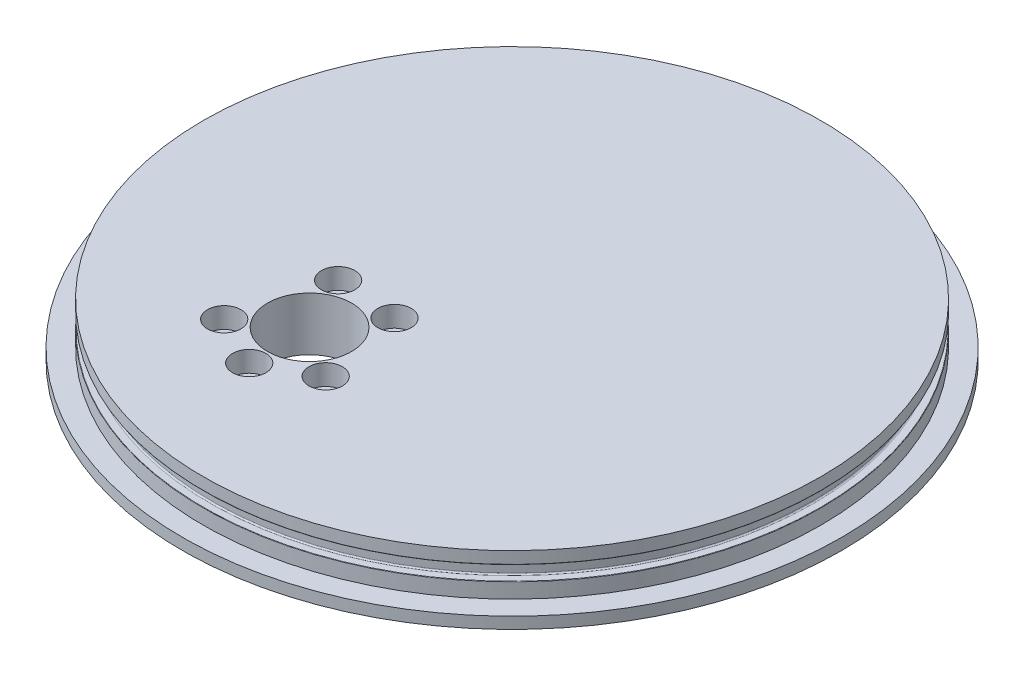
ISO-10303-21;
HEADER;
FILE_DESCRIPTION(('STEP AP214'),'2;1');
FILE_NAME('part.step','',(''),(''),'','','');
FILE_SCHEMA(('AUTOMOTIVE_DESIGN { 1 0 10303 214 1 1 1 1 }'));
ENDSEC;
DATA;
#1=APPLICATION_CONTEXT('core data for automotive mechanical design processes');
#2=APPLICATION_PROTOCOL_DEFINITION('international standard','automotive_design',2000,#1);
#3=PRODUCT_CONTEXT('',#1,'mechanical');
#4=PRODUCT('Part','Part','',(#3));
#5=PRODUCT_RELATED_PRODUCT_CATEGORY('part','',(#4));
#6=PRODUCT_DEFINITION_FORMATION('','',#4);
#7=PRODUCT_DEFINITION_CONTEXT('part definition',#1,'design');
#8=PRODUCT_DEFINITION('design','',#6,#7);
#9=PRODUCT_DEFINITION_SHAPE('','',#8);
#10=(LENGTH_UNIT() NAMED_UNIT(*) SI_UNIT(.MILLI.,.METRE.));
#11=(NAMED_UNIT(*) PLANE_ANGLE_UNIT() SI_UNIT($,.RADIAN.));
#12=(NAMED_UNIT(*) SI_UNIT($,.STERADIAN.) SOLID_ANGLE_UNIT());
#13=UNCERTAINTY_MEASURE_WITH_UNIT(LENGTH_MEASURE(1.E-05),#10,'distance_accuracy_value','');
#14=(GEOMETRIC_REPRESENTATION_CONTEXT(3) GLOBAL_UNCERTAINTY_ASSIGNED_CONTEXT((#13)) GLOBAL_UNIT_ASSIGNED_CONTEXT((#10,
#11,#12)) REPRESENTATION_CONTEXT('',''));
#15=CARTESIAN_POINT('',(0.,0.,0.));
#16=DIRECTION('',(0.,0.,1.));
#17=DIRECTION('',(1.,0.,0.));
#18=AXIS2_PLACEMENT_3D('',#15,#16,#17);
#19=CARTESIAN_POINT('',(0.,13.97,0.));
#20=DIRECTION('',(0.,-1.,0.));
#21=DIRECTION('',(1.,0.,0.));
#22=AXIS2_PLACEMENT_3D('',#19,#20,#21);
#23=PLANE('',#22);
#24=CARTESIAN_POINT('',(-34.2101364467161,13.97,23.5992409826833));
#25=DIRECTION('',(0.,1.,0.));
#26=DIRECTION('',(0.,0.,1.));
#27=AXIS2_PLACEMENT_3D('',#24,#25,#26);
#28=CIRCLE('',#27,5.55625);
#29=CARTESIAN_POINT('',(-34.2101364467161,13.97,29.1554909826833));
#30=VERTEX_POINT('',#29);
#31=EDGE_CURVE('E155',#30,#30,#28,.T.);
#32=ORIENTED_EDGE('',*,*,#31,.F.);
#33=EDGE_LOOP('',(#32));
#34=FACE_BOUND('',#33,.T.);
#35=CARTESIAN_POINT('',(-13.9474857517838,13.97,25.1248185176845));
#36=DIRECTION('',(0.,1.,0.));
#37=DIRECTION('',(0.,0.,1.));
#38=AXIS2_PLACEMENT_3D('',#35,#36,#37);
#39=CIRCLE('',#38,5.55625);
#40=CARTESIAN_POINT('',(-13.9474857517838,13.97,30.6810685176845));
#41=VERTEX_POINT('',#40);
#42=EDGE_CURVE('E143',#41,#41,#39,.T.);
#43=ORIENTED_EDGE('',*,*,#42,.F.);
#44=EDGE_LOOP('',(#43));
#45=FACE_BOUND('',#44,.T.);
#46=CARTESIAN_POINT('',(-41.8892371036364,13.97,53.7846561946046));
#47=DIRECTION('',(0.,1.,0.));
#48=DIRECTION('',(0.,0.,1.));
#49=AXIS2_PLACEMENT_3D('',#46,#47,#48);
#50=CIRCLE('',#49,5.55625);
#51=CARTESIAN_POINT('',(-41.8892371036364,13.97,59.3409061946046));
#52=VERTEX_POINT('',#51);
#53=EDGE_CURVE('E131',#52,#52,#50,.T.);
#54=ORIENTED_EDGE('',*,*,#53,.F.);
#55=EDGE_LOOP('',(#54));
#56=FACE_BOUND('',#55,.T.);
#57=CARTESIAN_POINT('',(-25.1306889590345,13.97,62.2282152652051));
#58=DIRECTION('',(0.,1.,0.));
#59=DIRECTION('',(0.,0.,1.));
#60=AXIS2_PLACEMENT_3D('',#57,#58,#59);
#61=CIRCLE('',#60,5.55625);
#62=CARTESIAN_POINT('',(-25.1306889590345,13.97,67.7844652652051));
#63=VERTEX_POINT('',#62);
#64=EDGE_CURVE('E119',#63,#63,#61,.T.);
#65=ORIENTED_EDGE('',*,*,#64,.F.);
#66=EDGE_LOOP('',(#65));
#67=FACE_BOUND('',#66,.T.);
#68=CARTESIAN_POINT('',(-8.60182196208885,13.97,53.3434428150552));
#69=DIRECTION('',(0.,1.,0.));
#70=DIRECTION('',(0.,0.,1.));
#71=AXIS2_PLACEMENT_3D('',#68,#69,#70);
#72=CIRCLE('',#71,5.55625);
#73=CARTESIAN_POINT('',(-8.60182196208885,13.97,58.8996928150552));
#74=VERTEX_POINT('',#73);
#75=EDGE_CURVE('E107',#74,#74,#72,.T.);
#76=ORIENTED_EDGE('',*,*,#75,.F.);
#77=EDGE_LOOP('',(#76));
#78=FACE_BOUND('',#77,.T.);
#79=CARTESIAN_POINT('',(-25.4,13.97,41.91));
#80=DIRECTION('',(0.,1.,0.));
#81=DIRECTION('',(-1.,0.,0.));
#82=AXIS2_PLACEMENT_3D('',#79,#80,#81);
#83=CIRCLE('',#82,13.97);
#84=CARTESIAN_POINT('',(-39.37,13.97,41.91));
#85=VERTEX_POINT('',#84);
#86=EDGE_CURVE('E93',#85,#85,#83,.T.);
#87=ORIENTED_EDGE('',*,*,#86,.F.);
#88=EDGE_LOOP('',(#87));
#89=FACE_BOUND('',#88,.T.);
#90=CARTESIAN_POINT('',(0.,13.97,0.));
#91=DIRECTION('',(0.,-1.,0.));
#92=DIRECTION('',(1.,0.,0.));
#93=AXIS2_PLACEMENT_3D('',#90,#91,#92);
#94=CIRCLE('',#93,102.5906);
#95=CARTESIAN_POINT('',(102.5906,13.97,0.));
#96=VERTEX_POINT('',#95);
#97=EDGE_CURVE('E10',#96,#96,#94,.T.);
#98=ORIENTED_EDGE('',*,*,#97,.F.);
#99=EDGE_LOOP('',(#98));
#100=FACE_BOUND('',#99,.T.);
#101=ADVANCED_FACE('F38',(#34,#45,#56,#67,#78,#89,#100),#23,.F.);
#102=CARTESIAN_POINT('',(0.,13.97,0.));
#103=DIRECTION('',(0.,-1.,0.));
#104=DIRECTION('',(1.,0.,0.));
#105=AXIS2_PLACEMENT_3D('',#102,#103,#104);
#106=CYLINDRICAL_SURFACE('',#105,102.5906);
#107=CARTESIAN_POINT('',(0.,10.0203,0.));
#108=DIRECTION('',(0.,-1.,0.));
#109=DIRECTION('',(1.,0.,0.));
#110=AXIS2_PLACEMENT_3D('',#107,#108,#109);
#111=CIRCLE('',#110,102.5906);
#112=CARTESIAN_POINT('',(102.5906,10.0203,0.));
#113=VERTEX_POINT('',#112);
#114=EDGE_CURVE('E44',#113,#113,#111,.T.);
#115=ORIENTED_EDGE('',*,*,#114,.F.);
#116=EDGE_LOOP('',(#115));
#117=FACE_BOUND('',#116,.T.);
#118=ORIENTED_EDGE('',*,*,#97,.T.);
#119=EDGE_LOOP('',(#118));
#120=FACE_BOUND('',#119,.T.);
#121=ADVANCED_FACE('F163',(#117,#120),#106,.T.);
#122=CARTESIAN_POINT('',(0.,10.0203,0.));
#123=DIRECTION('',(0.,-1.,0.));
#124=DIRECTION('',(1.,0.,0.));
#125=AXIS2_PLACEMENT_3D('',#122,#123,#124);
#126=TOROIDAL_SURFACE('',#125,102.4636,0.127000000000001);
#127=CARTESIAN_POINT('',(0.,9.8933,0.));
#128=DIRECTION('',(0.,-1.,0.));
#129=DIRECTION('',(1.,0.,0.));
#130=AXIS2_PLACEMENT_3D('',#127,#128,#129);
#131=CIRCLE('',#130,102.4636);
#132=CARTESIAN_POINT('',(102.4636,9.8933,0.));
#133=VERTEX_POINT('',#132);
#134=EDGE_CURVE('E49',#133,#133,#131,.T.);
#135=ORIENTED_EDGE('',*,*,#134,.F.);
#136=EDGE_LOOP('',(#135));
#137=FACE_BOUND('',#136,.T.);
#138=ORIENTED_EDGE('',*,*,#114,.T.);
#139=EDGE_LOOP('',(#138));
#140=FACE_BOUND('',#139,.T.);
#141=ADVANCED_FACE('F228',(#137,#140),#126,.T.);
#142=CARTESIAN_POINT('',(-102.4636,9.8933,0.));
#143=DIRECTION('',(0.,1.,0.));
#144=DIRECTION('',(-1.,0.,0.));
#145=AXIS2_PLACEMENT_3D('',#142,#143,#144);
#146=PLANE('',#145);
#147=CARTESIAN_POINT('',(0.,9.8933,0.));
#148=DIRECTION('',(0.,-1.,0.));
#149=DIRECTION('',(1.,0.,0.));
#150=AXIS2_PLACEMENT_3D('',#147,#148,#149);
#151=CIRCLE('',#150,100.2157);
#152=CARTESIAN_POINT('',(100.2157,9.8933,0.));
#153=VERTEX_POINT('',#152);
#154=EDGE_CURVE('E55',#153,#153,#151,.T.);
#155=ORIENTED_EDGE('',*,*,#154,.F.);
#156=EDGE_LOOP('',(#155));
#157=FACE_BOUND('',#156,.T.);
#158=ORIENTED_EDGE('',*,*,#134,.T.);
#159=EDGE_LOOP('',(#158));
#160=FACE_BOUND('',#159,.T.);
#161=ADVANCED_FACE('F224',(#157,#160),#146,.F.);
#162=CARTESIAN_POINT('',(0.,9.4488,0.));
#163=DIRECTION('',(0.,-1.,0.));
#164=DIRECTION('',(1.,0.,0.));
#165=AXIS2_PLACEMENT_3D('',#162,#163,#164);
#166=TOROIDAL_SURFACE('',#165,100.2157,0.4445);
#167=CARTESIAN_POINT('',(0.,9.4488,0.));
#168=DIRECTION('',(0.,-1.,0.));
#169=DIRECTION('',(1.,0.,0.));
#170=AXIS2_PLACEMENT_3D('',#167,#168,#169);
#171=CIRCLE('',#170,99.7712);
#172=CARTESIAN_POINT('',(99.7712,9.4488,0.));
#173=VERTEX_POINT('',#172);
#174=EDGE_CURVE('E61',#173,#173,#171,.T.);
#175=ORIENTED_EDGE('',*,*,#174,.F.);
#176=EDGE_LOOP('',(#175));
#177=FACE_BOUND('',#176,.T.);
#178=ORIENTED_EDGE('',*,*,#154,.T.);
#179=EDGE_LOOP('',(#178));
#180=FACE_BOUND('',#179,.T.);
#181=ADVANCED_FACE('F220',(#177,#180),#166,.F.);
#182=CARTESIAN_POINT('',(0.,13.97,0.));
#183=DIRECTION('',(0.,-1.,0.));
#184=DIRECTION('',(1.,0.,0.));
#185=AXIS2_PLACEMENT_3D('',#182,#183,#184);
#186=CYLINDRICAL_SURFACE('',#185,99.7712);
#187=CARTESIAN_POINT('',(0.,5.5245,0.));
#188=DIRECTION('',(0.,-1.,0.));
#189=DIRECTION('',(1.,0.,0.));
#190=AXIS2_PLACEMENT_3D('',#187,#188,#189);
#191=CIRCLE('',#190,99.7712);
#192=CARTESIAN_POINT('',(99.7712,5.5245,0.));
#193=VERTEX_POINT('',#192);
#194=EDGE_CURVE('E65',#193,#193,#191,.T.);
#195=ORIENTED_EDGE('',*,*,#194,.F.);
#196=EDGE_LOOP('',(#195));
#197=FACE_BOUND('',#196,.T.);
#198=ORIENTED_EDGE('',*,*,#174,.T.);
#199=EDGE_LOOP('',(#198));
#200=FACE_BOUND('',#199,.T.);
#201=ADVANCED_FACE('F216',(#197,#200),#186,.T.);
#202=CARTESIAN_POINT('',(0.,5.5245,0.));
#203=DIRECTION('',(0.,-1.,0.));
#204=DIRECTION('',(1.,0.,0.));
#205=AXIS2_PLACEMENT_3D('',#202,#203,#204);
#206=TOROIDAL_SURFACE('',#205,100.2157,0.4445);
#207=CARTESIAN_POINT('',(0.,5.08,0.));
#208=DIRECTION('',(0.,-1.,0.));
#209=DIRECTION('',(1.,0.,0.));
#210=AXIS2_PLACEMENT_3D('',#207,#208,#209);
#211=CIRCLE('',#210,100.2157);
#212=CARTESIAN_POINT('',(100.2157,5.08,0.));
#213=VERTEX_POINT('',#212);
#214=EDGE_CURVE('E69',#213,#213,#211,.T.);
#215=ORIENTED_EDGE('',*,*,#214,.F.);
#216=EDGE_LOOP('',(#215));
#217=FACE_BOUND('',#216,.T.);
#218=ORIENTED_EDGE('',*,*,#194,.T.);
#219=EDGE_LOOP('',(#218));
#220=FACE_BOUND('',#219,.T.);
#221=ADVANCED_FACE('F212',(#217,#220),#206,.F.);
#222=CARTESIAN_POINT('',(-102.4636,5.08,0.));
#223=DIRECTION('',(0.,-1.,0.));
#224=DIRECTION('',(1.,0.,0.));
#225=AXIS2_PLACEMENT_3D('',#222,#223,#224);
#226=PLANE('',#225);
#227=CARTESIAN_POINT('',(0.,5.08,0.));
#228=DIRECTION('',(0.,-1.,0.));
#229=DIRECTION('',(1.,0.,0.));
#230=AXIS2_PLACEMENT_3D('',#227,#228,#229);
#231=CIRCLE('',#230,102.4636);
#232=CARTESIAN_POINT('',(102.4636,5.08,0.));
#233=VERTEX_POINT('',#232);
#234=EDGE_CURVE('E73',#233,#233,#231,.T.);
#235=ORIENTED_EDGE('',*,*,#234,.F.);
#236=EDGE_LOOP('',(#235));
#237=FACE_BOUND('',#236,.T.);
#238=ORIENTED_EDGE('',*,*,#214,.T.);
#239=EDGE_LOOP('',(#238));
#240=FACE_BOUND('',#239,.T.);
#241=ADVANCED_FACE('F208',(#237,#240),#226,.F.);
#242=CARTESIAN_POINT('',(0.,4.953,0.));
#243=DIRECTION('',(0.,-1.,0.));
#244=DIRECTION('',(1.,0.,0.));
#245=AXIS2_PLACEMENT_3D('',#242,#243,#244);
#246=TOROIDAL_SURFACE('',#245,102.4636,0.127000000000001);
#247=CARTESIAN_POINT('',(0.,4.953,0.));
#248=DIRECTION('',(0.,-1.,0.));
#249=DIRECTION('',(1.,0.,0.));
#250=AXIS2_PLACEMENT_3D('',#247,#248,#249);
#251=CIRCLE('',#250,102.5906);
#252=CARTESIAN_POINT('',(102.5906,4.953,0.));
#253=VERTEX_POINT('',#252);
#254=EDGE_CURVE('E77',#253,#253,#251,.T.);
#255=ORIENTED_EDGE('',*,*,#254,.F.);
#256=EDGE_LOOP('',(#255));
#257=FACE_BOUND('',#256,.T.);
#258=ORIENTED_EDGE('',*,*,#234,.T.);
#259=EDGE_LOOP('',(#258));
#260=FACE_BOUND('',#259,.T.);
#261=ADVANCED_FACE('F204',(#257,#260),#246,.T.);
#262=CARTESIAN_POINT('',(0.,13.97,0.));
#263=DIRECTION('',(0.,-1.,0.));
#264=DIRECTION('',(1.,0.,0.));
#265=AXIS2_PLACEMENT_3D('',#262,#263,#264);
#266=CYLINDRICAL_SURFACE('',#265,102.5906);
#267=CARTESIAN_POINT('',(0.,0.,0.));
#268=DIRECTION('',(0.,-1.,0.));
#269=DIRECTION('',(1.,0.,0.));
#270=AXIS2_PLACEMENT_3D('',#267,#268,#269);
#271=CIRCLE('',#270,102.5906);
#272=CARTESIAN_POINT('',(102.5906,0.,0.));
#273=VERTEX_POINT('',#272);
#274=EDGE_CURVE('E80',#273,#273,#271,.T.);
#275=ORIENTED_EDGE('',*,*,#274,.F.);
#276=EDGE_LOOP('',(#275));
#277=FACE_BOUND('',#276,.T.);
#278=ORIENTED_EDGE('',*,*,#254,.T.);
#279=EDGE_LOOP('',(#278));
#280=FACE_BOUND('',#279,.T.);
#281=ADVANCED_FACE('F200',(#277,#280),#266,.T.);
#282=CARTESIAN_POINT('',(-102.5906,0.,0.));
#283=DIRECTION('',(0.,-1.,0.));
#284=DIRECTION('',(1.,0.,0.));
#285=AXIS2_PLACEMENT_3D('',#282,#283,#284);
#286=PLANE('',#285);
#287=CARTESIAN_POINT('',(0.,0.,0.));
#288=DIRECTION('',(0.,-1.,0.));
#289=DIRECTION('',(1.,0.,0.));
#290=AXIS2_PLACEMENT_3D('',#287,#288,#289);
#291=CIRCLE('',#290,109.537499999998);
#292=CARTESIAN_POINT('',(109.537499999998,0.,0.));
#293=VERTEX_POINT('',#292);
#294=EDGE_CURVE('E84',#293,#293,#291,.T.);
#295=ORIENTED_EDGE('',*,*,#294,.F.);
#296=EDGE_LOOP('',(#295));
#297=FACE_BOUND('',#296,.T.);
#298=ORIENTED_EDGE('',*,*,#274,.T.);
#299=EDGE_LOOP('',(#298));
#300=FACE_BOUND('',#299,.T.);
#301=ADVANCED_FACE('F196',(#297,#300),#286,.F.);
#302=CARTESIAN_POINT('',(0.,13.97,0.));
#303=DIRECTION('',(0.,-1.,0.));
#304=DIRECTION('',(1.,0.,0.));
#305=AXIS2_PLACEMENT_3D('',#302,#303,#304);
#306=CYLINDRICAL_SURFACE('',#305,109.537499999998);
#307=CARTESIAN_POINT('',(0.,-3.81,0.));
#308=DIRECTION('',(0.,-1.,0.));
#309=DIRECTION('',(1.,0.,0.));
#310=AXIS2_PLACEMENT_3D('',#307,#308,#309);
#311=CIRCLE('',#310,109.537499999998);
#312=CARTESIAN_POINT('',(109.537499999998,-3.81,0.));
#313=VERTEX_POINT('',#312);
#314=EDGE_CURVE('E88',#313,#313,#311,.T.);
#315=ORIENTED_EDGE('',*,*,#314,.F.);
#316=EDGE_LOOP('',(#315));
#317=FACE_BOUND('',#316,.T.);
#318=ORIENTED_EDGE('',*,*,#294,.T.);
#319=EDGE_LOOP('',(#318));
#320=FACE_BOUND('',#319,.T.);
#321=ADVANCED_FACE('F188',(#317,#320),#306,.T.);
#322=CARTESIAN_POINT('',(-109.537499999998,-3.81,0.));
#323=DIRECTION('',(0.,1.,0.));
#324=DIRECTION('',(-1.,0.,0.));
#325=AXIS2_PLACEMENT_3D('',#322,#323,#324);
#326=PLANE('',#325);
#327=CARTESIAN_POINT('',(-34.2101364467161,-3.81,23.5992409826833));
#328=DIRECTION('',(0.,1.,0.));
#329=DIRECTION('',(0.,0.,1.));
#330=AXIS2_PLACEMENT_3D('',#327,#328,#329);
#331=CIRCLE('',#330,3.37819999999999);
#332=CARTESIAN_POINT('',(-34.2101364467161,-3.81,26.9774409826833));
#333=VERTEX_POINT('',#332);
#334=EDGE_CURVE('E146',#333,#333,#331,.T.);
#335=ORIENTED_EDGE('',*,*,#334,.T.);
#336=EDGE_LOOP('',(#335));
#337=FACE_BOUND('',#336,.T.);
#338=CARTESIAN_POINT('',(-13.9474857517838,-3.81,25.1248185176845));
#339=DIRECTION('',(0.,1.,0.));
#340=DIRECTION('',(0.,0.,1.));
#341=AXIS2_PLACEMENT_3D('',#338,#339,#340);
#342=CIRCLE('',#341,3.37819999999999);
#343=CARTESIAN_POINT('',(-13.9474857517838,-3.81,28.5030185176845));
#344=VERTEX_POINT('',#343);
#345=EDGE_CURVE('E134',#344,#344,#342,.T.);
#346=ORIENTED_EDGE('',*,*,#345,.T.);
#347=EDGE_LOOP('',(#346));
#348=FACE_BOUND('',#347,.T.);
#349=CARTESIAN_POINT('',(-41.8892371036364,-3.81,53.7846561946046));
#350=DIRECTION('',(0.,1.,0.));
#351=DIRECTION('',(0.,0.,1.));
#352=AXIS2_PLACEMENT_3D('',#349,#350,#351);
#353=CIRCLE('',#352,3.3782);
#354=CARTESIAN_POINT('',(-41.8892371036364,-3.81,57.1628561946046));
#355=VERTEX_POINT('',#354);
#356=EDGE_CURVE('E122',#355,#355,#353,.T.);
#357=ORIENTED_EDGE('',*,*,#356,.T.);
#358=EDGE_LOOP('',(#357));
#359=FACE_BOUND('',#358,.T.);
#360=CARTESIAN_POINT('',(-25.1306889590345,-3.81,62.2282152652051));
#361=DIRECTION('',(0.,1.,0.));
#362=DIRECTION('',(0.,0.,1.));
#363=AXIS2_PLACEMENT_3D('',#360,#361,#362);
#364=CIRCLE('',#363,3.37819999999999);
#365=CARTESIAN_POINT('',(-25.1306889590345,-3.81,65.6064152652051));
#366=VERTEX_POINT('',#365);
#367=EDGE_CURVE('E110',#366,#366,#364,.T.);
#368=ORIENTED_EDGE('',*,*,#367,.T.);
#369=EDGE_LOOP('',(#368));
#370=FACE_BOUND('',#369,.T.);
#371=CARTESIAN_POINT('',(-8.60182196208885,-3.81,53.3434428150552));
#372=DIRECTION('',(0.,1.,0.));
#373=DIRECTION('',(0.,0.,1.));
#374=AXIS2_PLACEMENT_3D('',#371,#372,#373);
#375=CIRCLE('',#374,3.37819999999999);
#376=CARTESIAN_POINT('',(-8.60182196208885,-3.81,56.7216428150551));
#377=VERTEX_POINT('',#376);
#378=EDGE_CURVE('E96',#377,#377,#375,.T.);
#379=ORIENTED_EDGE('',*,*,#378,.T.);
#380=EDGE_LOOP('',(#379));
#381=FACE_BOUND('',#380,.T.);
#382=CARTESIAN_POINT('',(-25.4,-3.81,41.91));
#383=DIRECTION('',(0.,1.,0.));
#384=DIRECTION('',(-1.,0.,0.));
#385=AXIS2_PLACEMENT_3D('',#382,#383,#384);
#386=CIRCLE('',#385,13.97);
#387=CARTESIAN_POINT('',(-39.37,-3.81,41.91));
#388=VERTEX_POINT('',#387);
#389=EDGE_CURVE('E92',#388,#388,#386,.T.);
#390=ORIENTED_EDGE('',*,*,#389,.T.);
#391=EDGE_LOOP('',(#390));
#392=FACE_BOUND('',#391,.T.);
#393=ORIENTED_EDGE('',*,*,#314,.T.);
#394=EDGE_LOOP('',(#393));
#395=FACE_BOUND('',#394,.T.);
#396=ADVANCED_FACE('F178',(#337,#348,#359,#370,#381,#392,#395),#326,.F.);
#397=CARTESIAN_POINT('',(-25.4,-3.81,41.91));
#398=DIRECTION('',(0.,1.,0.));
#399=DIRECTION('',(-1.,0.,0.));
#400=AXIS2_PLACEMENT_3D('',#397,#398,#399);
#401=CYLINDRICAL_SURFACE('',#400,13.97);
#402=ORIENTED_EDGE('',*,*,#389,.F.);
#403=EDGE_LOOP('',(#402));
#404=FACE_BOUND('',#403,.T.);
#405=ORIENTED_EDGE('',*,*,#86,.T.);
#406=EDGE_LOOP('',(#405));
#407=FACE_BOUND('',#406,.T.);
#408=ADVANCED_FACE('F175',(#404,#407),#401,.F.);
#409=CARTESIAN_POINT('',(-8.60182196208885,13.97,53.3434428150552));
#410=DIRECTION('',(0.,1.,0.));
#411=DIRECTION('',(0.,0.,1.));
#412=AXIS2_PLACEMENT_3D('',#409,#410,#411);
#413=CYLINDRICAL_SURFACE('',#412,3.3782);
#414=ORIENTED_EDGE('',*,*,#378,.F.);
#415=EDGE_LOOP('',(#414));
#416=FACE_BOUND('',#415,.T.);
#417=CARTESIAN_POINT('',(-8.60182196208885,7.11199999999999,53.3434428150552));
#418=DIRECTION('',(0.,1.,0.));
#419=DIRECTION('',(0.,0.,1.));
#420=AXIS2_PLACEMENT_3D('',#417,#418,#419);
#421=CIRCLE('',#420,3.3782);
#422=CARTESIAN_POINT('',(-8.60182196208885,7.11199999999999,56.7216428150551));
#423=VERTEX_POINT('',#422);
#424=EDGE_CURVE('E101',#423,#423,#421,.T.);
#425=ORIENTED_EDGE('',*,*,#424,.T.);
#426=EDGE_LOOP('',(#425));
#427=FACE_BOUND('',#426,.T.);
#428=ADVANCED_FACE('F177',(#416,#427),#413,.F.);
#429=CARTESIAN_POINT('',(-5.22362196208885,7.11199999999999,53.3434428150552));
#430=DIRECTION('',(0.,-1.,0.));
#431=DIRECTION('',(0.,0.,-1.));
#432=AXIS2_PLACEMENT_3D('',#429,#430,#431);
#433=PLANE('',#432);
#434=ORIENTED_EDGE('',*,*,#424,.F.);
#435=EDGE_LOOP('',(#434));
#436=FACE_BOUND('',#435,.T.);
#437=CARTESIAN_POINT('',(-8.60182196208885,7.11199999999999,53.3434428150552));
#438=DIRECTION('',(0.,1.,0.));
#439=DIRECTION('',(0.,0.,1.));
#440=AXIS2_PLACEMENT_3D('',#437,#438,#439);
#441=CIRCLE('',#440,5.55625);
#442=CARTESIAN_POINT('',(-8.60182196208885,7.11199999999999,58.8996928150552));
#443=VERTEX_POINT('',#442);
#444=EDGE_CURVE('E104',#443,#443,#441,.T.);
#445=ORIENTED_EDGE('',*,*,#444,.T.);
#446=EDGE_LOOP('',(#445));
#447=FACE_BOUND('',#446,.T.);
#448=ADVANCED_FACE('F185',(#436,#447),#433,.F.);
#449=CARTESIAN_POINT('',(-8.60182196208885,13.97,53.3434428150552));
#450=DIRECTION('',(0.,1.,0.));
#451=DIRECTION('',(0.,0.,1.));
#452=AXIS2_PLACEMENT_3D('',#449,#450,#451);
#453=CYLINDRICAL_SURFACE('',#452,5.55625);
#454=ORIENTED_EDGE('',*,*,#444,.F.);
#455=EDGE_LOOP('',(#454));
#456=FACE_BOUND('',#455,.T.);
#457=ORIENTED_EDGE('',*,*,#75,.T.);
#458=EDGE_LOOP('',(#457));
#459=FACE_BOUND('',#458,.T.);
#460=ADVANCED_FACE('F306',(#456,#459),#453,.F.);
#461=CARTESIAN_POINT('',(-25.1306889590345,13.97,62.2282152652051));
#462=DIRECTION('',(0.,1.,0.));
#463=DIRECTION('',(0.,0.,1.));
#464=AXIS2_PLACEMENT_3D('',#461,#462,#463);
#465=CYLINDRICAL_SURFACE('',#464,3.3782);
#466=ORIENTED_EDGE('',*,*,#367,.F.);
#467=EDGE_LOOP('',(#466));
#468=FACE_BOUND('',#467,.T.);
#469=CARTESIAN_POINT('',(-25.1306889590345,7.11199999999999,62.2282152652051));
#470=DIRECTION('',(0.,1.,0.));
#471=DIRECTION('',(0.,0.,1.));
#472=AXIS2_PLACEMENT_3D('',#469,#470,#471);
#473=CIRCLE('',#472,3.3782);
#474=CARTESIAN_POINT('',(-25.1306889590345,7.11199999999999,65.6064152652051));
#475=VERTEX_POINT('',#474);
#476=EDGE_CURVE('E113',#475,#475,#473,.T.);
#477=ORIENTED_EDGE('',*,*,#476,.T.);
#478=EDGE_LOOP('',(#477));
#479=FACE_BOUND('',#478,.T.);
#480=ADVANCED_FACE('F314',(#468,#479),#465,.F.);
#481=CARTESIAN_POINT('',(-21.7524889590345,7.11199999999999,62.2282152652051));
#482=DIRECTION('',(0.,-1.,0.));
#483=DIRECTION('',(0.,0.,-1.));
#484=AXIS2_PLACEMENT_3D('',#481,#482,#483);
#485=PLANE('',#484);
#486=ORIENTED_EDGE('',*,*,#476,.F.);
#487=EDGE_LOOP('',(#486));
#488=FACE_BOUND('',#487,.T.);
#489=CARTESIAN_POINT('',(-25.1306889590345,7.11199999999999,62.2282152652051));
#490=DIRECTION('',(0.,1.,0.));
#491=DIRECTION('',(0.,0.,1.));
#492=AXIS2_PLACEMENT_3D('',#489,#490,#491);
#493=CIRCLE('',#492,5.55625);
#494=CARTESIAN_POINT('',(-25.1306889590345,7.11199999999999,67.7844652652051));
#495=VERTEX_POINT('',#494);
#496=EDGE_CURVE('E116',#495,#495,#493,.T.);
#497=ORIENTED_EDGE('',*,*,#496,.T.);
#498=EDGE_LOOP('',(#497));
#499=FACE_BOUND('',#498,.T.);
#500=ADVANCED_FACE('F323',(#488,#499),#485,.F.);
#501=CARTESIAN_POINT('',(-25.1306889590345,13.97,62.2282152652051));
#502=DIRECTION('',(0.,1.,0.));
#503=DIRECTION('',(0.,0.,1.));
#504=AXIS2_PLACEMENT_3D('',#501,#502,#503);
#505=CYLINDRICAL_SURFACE('',#504,5.55625);
#506=ORIENTED_EDGE('',*,*,#496,.F.);
#507=EDGE_LOOP('',(#506));
#508=FACE_BOUND('',#507,.T.);
#509=ORIENTED_EDGE('',*,*,#64,.T.);
#510=EDGE_LOOP('',(#509));
#511=FACE_BOUND('',#510,.T.);
#512=ADVANCED_FACE('F332',(#508,#511),#505,.F.);
#513=CARTESIAN_POINT('',(-41.8892371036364,13.97,53.7846561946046));
#514=DIRECTION('',(0.,1.,0.));
#515=DIRECTION('',(0.,0.,1.));
#516=AXIS2_PLACEMENT_3D('',#513,#514,#515);
#517=CYLINDRICAL_SURFACE('',#516,3.3782);
#518=ORIENTED_EDGE('',*,*,#356,.F.);
#519=EDGE_LOOP('',(#518));
#520=FACE_BOUND('',#519,.T.);
#521=CARTESIAN_POINT('',(-41.8892371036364,7.11199999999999,53.7846561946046));
#522=DIRECTION('',(0.,1.,0.));
#523=DIRECTION('',(0.,0.,1.));
#524=AXIS2_PLACEMENT_3D('',#521,#522,#523);
#525=CIRCLE('',#524,3.3782);
#526=CARTESIAN_POINT('',(-41.8892371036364,7.11199999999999,57.1628561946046));
#527=VERTEX_POINT('',#526);
#528=EDGE_CURVE('E125',#527,#527,#525,.T.);
#529=ORIENTED_EDGE('',*,*,#528,.T.);
#530=EDGE_LOOP('',(#529));
#531=FACE_BOUND('',#530,.T.);
#532=ADVANCED_FACE('F341',(#520,#531),#517,.F.);
#533=CARTESIAN_POINT('',(-38.5110371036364,7.11199999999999,53.7846561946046));
#534=DIRECTION('',(0.,-1.,0.));
#535=DIRECTION('',(0.,0.,-1.));
#536=AXIS2_PLACEMENT_3D('',#533,#534,#535);
#537=PLANE('',#536);
#538=ORIENTED_EDGE('',*,*,#528,.F.);
#539=EDGE_LOOP('',(#538));
#540=FACE_BOUND('',#539,.T.);
#541=CARTESIAN_POINT('',(-41.8892371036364,7.11199999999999,53.7846561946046));
#542=DIRECTION('',(0.,1.,0.));
#543=DIRECTION('',(0.,0.,1.));
#544=AXIS2_PLACEMENT_3D('',#541,#542,#543);
#545=CIRCLE('',#544,5.55625);
#546=CARTESIAN_POINT('',(-41.8892371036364,7.11199999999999,59.3409061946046));
#547=VERTEX_POINT('',#546);
#548=EDGE_CURVE('E128',#547,#547,#545,.T.);
#549=ORIENTED_EDGE('',*,*,#548,.T.);
#550=EDGE_LOOP('',(#549));
#551=FACE_BOUND('',#550,.T.);
#552=ADVANCED_FACE('F350',(#540,#551),#537,.F.);
#553=CARTESIAN_POINT('',(-41.8892371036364,13.97,53.7846561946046));
#554=DIRECTION('',(0.,1.,0.));
#555=DIRECTION('',(0.,0.,1.));
#556=AXIS2_PLACEMENT_3D('',#553,#554,#555);
#557=CYLINDRICAL_SURFACE('',#556,5.55625);
#558=ORIENTED_EDGE('',*,*,#548,.F.);
#559=EDGE_LOOP('',(#558));
#560=FACE_BOUND('',#559,.T.);
#561=ORIENTED_EDGE('',*,*,#53,.T.);
#562=EDGE_LOOP('',(#561));
#563=FACE_BOUND('',#562,.T.);
#564=ADVANCED_FACE('F359',(#560,#563),#557,.F.);
#565=CARTESIAN_POINT('',(-13.9474857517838,13.97,25.1248185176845));
#566=DIRECTION('',(0.,1.,0.));
#567=DIRECTION('',(0.,0.,1.));
#568=AXIS2_PLACEMENT_3D('',#565,#566,#567);
#569=CYLINDRICAL_SURFACE('',#568,3.3782);
#570=ORIENTED_EDGE('',*,*,#345,.F.);
#571=EDGE_LOOP('',(#570));
#572=FACE_BOUND('',#571,.T.);
#573=CARTESIAN_POINT('',(-13.9474857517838,7.11199999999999,25.1248185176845));
#574=DIRECTION('',(0.,1.,0.));
#575=DIRECTION('',(0.,0.,1.));
#576=AXIS2_PLACEMENT_3D('',#573,#574,#575);
#577=CIRCLE('',#576,3.3782);
#578=CARTESIAN_POINT('',(-13.9474857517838,7.11199999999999,28.5030185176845));
#579=VERTEX_POINT('',#578);
#580=EDGE_CURVE('E137',#579,#579,#577,.T.);
#581=ORIENTED_EDGE('',*,*,#580,.T.);
#582=EDGE_LOOP('',(#581));
#583=FACE_BOUND('',#582,.T.);
#584=ADVANCED_FACE('F368',(#572,#583),#569,.F.);
#585=CARTESIAN_POINT('',(-10.5692857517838,7.11199999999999,25.1248185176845));
#586=DIRECTION('',(0.,-1.,0.));
#587=DIRECTION('',(0.,0.,-1.));
#588=AXIS2_PLACEMENT_3D('',#585,#586,#587);
#589=PLANE('',#588);
#590=ORIENTED_EDGE('',*,*,#580,.F.);
#591=EDGE_LOOP('',(#590));
#592=FACE_BOUND('',#591,.T.);
#593=CARTESIAN_POINT('',(-13.9474857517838,7.11199999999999,25.1248185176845));
#594=DIRECTION('',(0.,1.,0.));
#595=DIRECTION('',(0.,0.,1.));
#596=AXIS2_PLACEMENT_3D('',#593,#594,#595);
#597=CIRCLE('',#596,5.55625);
#598=CARTESIAN_POINT('',(-13.9474857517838,7.11199999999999,30.6810685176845));
#599=VERTEX_POINT('',#598);
#600=EDGE_CURVE('E140',#599,#599,#597,.T.);
#601=ORIENTED_EDGE('',*,*,#600,.T.);
#602=EDGE_LOOP('',(#601));
#603=FACE_BOUND('',#602,.T.);
#604=ADVANCED_FACE('F377',(#592,#603),#589,.F.);
#605=CARTESIAN_POINT('',(-13.9474857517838,13.97,25.1248185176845));
#606=DIRECTION('',(0.,1.,0.));
#607=DIRECTION('',(0.,0.,1.));
#608=AXIS2_PLACEMENT_3D('',#605,#606,#607);
#609=CYLINDRICAL_SURFACE('',#608,5.55625);
#610=ORIENTED_EDGE('',*,*,#600,.F.);
#611=EDGE_LOOP('',(#610));
#612=FACE_BOUND('',#611,.T.);
#613=ORIENTED_EDGE('',*,*,#42,.T.);
#614=EDGE_LOOP('',(#613));
#615=FACE_BOUND('',#614,.T.);
#616=ADVANCED_FACE('F386',(#612,#615),#609,.F.);
#617=CARTESIAN_POINT('',(-34.2101364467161,13.97,23.5992409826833));
#618=DIRECTION('',(0.,1.,0.));
#619=DIRECTION('',(0.,0.,1.));
#620=AXIS2_PLACEMENT_3D('',#617,#618,#619);
#621=CYLINDRICAL_SURFACE('',#620,3.3782);
#622=ORIENTED_EDGE('',*,*,#334,.F.);
#623=EDGE_LOOP('',(#622));
#624=FACE_BOUND('',#623,.T.);
#625=CARTESIAN_POINT('',(-34.2101364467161,7.11199999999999,23.5992409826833));
#626=DIRECTION('',(0.,1.,0.));
#627=DIRECTION('',(0.,0.,1.));
#628=AXIS2_PLACEMENT_3D('',#625,#626,#627);
#629=CIRCLE('',#628,3.3782);
#630=CARTESIAN_POINT('',(-34.2101364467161,7.11199999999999,26.9774409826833));
#631=VERTEX_POINT('',#630);
#632=EDGE_CURVE('E149',#631,#631,#629,.T.);
#633=ORIENTED_EDGE('',*,*,#632,.T.);
#634=EDGE_LOOP('',(#633));
#635=FACE_BOUND('',#634,.T.);
#636=ADVANCED_FACE('F395',(#624,#635),#621,.F.);
#637=CARTESIAN_POINT('',(-30.8319364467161,7.11199999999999,23.5992409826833));
#638=DIRECTION('',(0.,-1.,0.));
#639=DIRECTION('',(0.,0.,-1.));
#640=AXIS2_PLACEMENT_3D('',#637,#638,#639);
#641=PLANE('',#640);
#642=ORIENTED_EDGE('',*,*,#632,.F.);
#643=EDGE_LOOP('',(#642));
#644=FACE_BOUND('',#643,.T.);
#645=CARTESIAN_POINT('',(-34.2101364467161,7.11199999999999,23.5992409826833));
#646=DIRECTION('',(0.,1.,0.));
#647=DIRECTION('',(0.,0.,1.));
#648=AXIS2_PLACEMENT_3D('',#645,#646,#647);
#649=CIRCLE('',#648,5.55625);
#650=CARTESIAN_POINT('',(-34.2101364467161,7.11199999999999,29.1554909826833));
#651=VERTEX_POINT('',#650);
#652=EDGE_CURVE('E152',#651,#651,#649,.T.);
#653=ORIENTED_EDGE('',*,*,#652,.T.);
#654=EDGE_LOOP('',(#653));
#655=FACE_BOUND('',#654,.T.);
#656=ADVANCED_FACE('F404',(#644,#655),#641,.F.);
#657=CARTESIAN_POINT('',(-34.2101364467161,13.97,23.5992409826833));
#658=DIRECTION('',(0.,1.,0.));
#659=DIRECTION('',(0.,0.,1.));
#660=AXIS2_PLACEMENT_3D('',#657,#658,#659);
#661=CYLINDRICAL_SURFACE('',#660,5.55625);
#662=ORIENTED_EDGE('',*,*,#652,.F.);
#663=EDGE_LOOP('',(#662));
#664=FACE_BOUND('',#663,.T.);
#665=ORIENTED_EDGE('',*,*,#31,.T.);
#666=EDGE_LOOP('',(#665));
#667=FACE_BOUND('',#666,.T.);
#668=ADVANCED_FACE('F159',(#664,#667),#661,.F.);
#669=CLOSED_SHELL('',(#101,#121,#141,#161,#181,#201,#221,#241,#261,#281,#301,#321,#396,#408,
#428,#448,#460,#480,#500,#512,#532,#552,#564,#584,#604,#616,#636,#656,#668));
#670=MANIFOLD_SOLID_BREP('B2',#669);
#671=ADVANCED_BREP_SHAPE_REPRESENTATION('',(#18,#670),#14);
#672=SHAPE_DEFINITION_REPRESENTATION(#9,#671);
ENDSEC;
END-ISO-10303-21;
